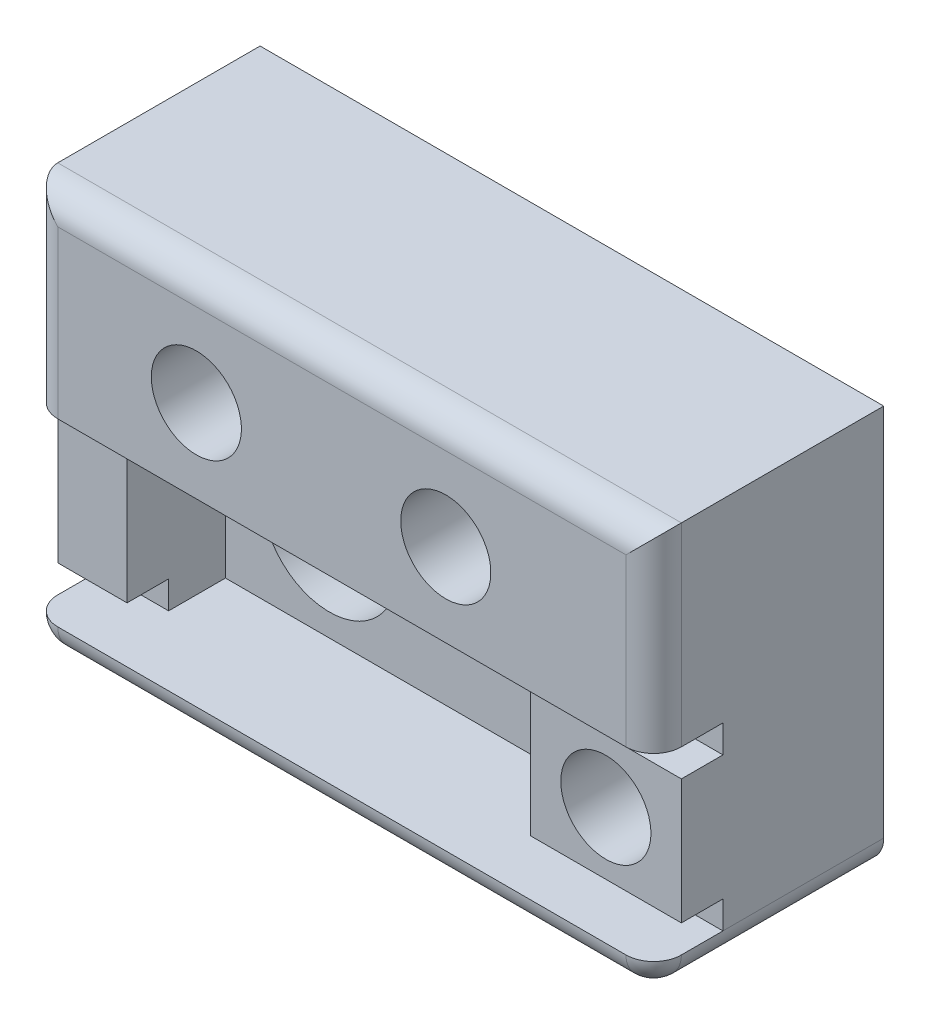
ISO-10303-21;
HEADER;
FILE_DESCRIPTION(('STEP AP214'),'2;1');
FILE_NAME('part.step','',(''),(''),'','','');
FILE_SCHEMA(('AUTOMOTIVE_DESIGN { 1 0 10303 214 1 1 1 1 }'));
ENDSEC;
DATA;
#1=APPLICATION_CONTEXT('core data for automotive mechanical design processes');
#2=APPLICATION_PROTOCOL_DEFINITION('international standard','automotive_design',2000,#1);
#3=PRODUCT_CONTEXT('',#1,'mechanical');
#4=PRODUCT('Part','Part','',(#3));
#5=PRODUCT_RELATED_PRODUCT_CATEGORY('part','',(#4));
#6=PRODUCT_DEFINITION_FORMATION('','',#4);
#7=PRODUCT_DEFINITION_CONTEXT('part definition',#1,'design');
#8=PRODUCT_DEFINITION('design','',#6,#7);
#9=PRODUCT_DEFINITION_SHAPE('','',#8);
#10=(LENGTH_UNIT() NAMED_UNIT(*) SI_UNIT(.MILLI.,.METRE.));
#11=(NAMED_UNIT(*) PLANE_ANGLE_UNIT() SI_UNIT($,.RADIAN.));
#12=(NAMED_UNIT(*) SI_UNIT($,.STERADIAN.) SOLID_ANGLE_UNIT());
#13=UNCERTAINTY_MEASURE_WITH_UNIT(LENGTH_MEASURE(1.E-05),#10,'distance_accuracy_value','');
#14=(GEOMETRIC_REPRESENTATION_CONTEXT(3) GLOBAL_UNCERTAINTY_ASSIGNED_CONTEXT((#13)) GLOBAL_UNIT_ASSIGNED_CONTEXT((#10,
#11,#12)) REPRESENTATION_CONTEXT('',''));
#15=CARTESIAN_POINT('',(0.,0.,0.));
#16=DIRECTION('',(0.,0.,1.));
#17=DIRECTION('',(1.,0.,0.));
#18=AXIS2_PLACEMENT_3D('',#15,#16,#17);
#19=CARTESIAN_POINT('',(30.,24.5,7.5));
#20=DIRECTION('',(0.,0.,-1.));
#21=DIRECTION('',(-1.,0.,0.));
#22=AXIS2_PLACEMENT_3D('',#19,#20,#21);
#23=CYLINDRICAL_SURFACE('',#22,1.65);
#24=CARTESIAN_POINT('',(30.,24.5,7.5));
#25=DIRECTION('',(0.,0.,1.));
#26=DIRECTION('',(1.,0.,0.));
#27=AXIS2_PLACEMENT_3D('',#24,#25,#26);
#28=CIRCLE('',#27,1.65);
#29=CARTESIAN_POINT('',(28.35,24.5,7.5));
#30=VERTEX_POINT('',#29);
#31=EDGE_CURVE('E380',#30,#30,#28,.F.);
#32=CARTESIAN_POINT('',(30.,24.5,9.5));
#33=DIRECTION('',(0.,0.,-1.));
#34=DIRECTION('',(-1.,0.,0.));
#35=AXIS2_PLACEMENT_3D('',#32,#33,#34);
#36=CIRCLE('',#35,1.65);
#37=CARTESIAN_POINT('',(28.35,24.5,9.5));
#38=VERTEX_POINT('',#37);
#39=EDGE_CURVE('E227',#38,#38,#36,.F.);
#40=CARTESIAN_POINT('',(28.35,24.5,7.5));
#41=CARTESIAN_POINT('',(28.35,24.5,7.52083333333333));
#42=CARTESIAN_POINT('',(28.35,24.5,7.54166666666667));
#43=CARTESIAN_POINT('',(28.35,24.5,7.58333333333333));
#44=CARTESIAN_POINT('',(28.35,24.5,7.60416666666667));
#45=CARTESIAN_POINT('',(28.35,24.5,7.64583333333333));
#46=CARTESIAN_POINT('',(28.35,24.5,7.66666666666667));
#47=CARTESIAN_POINT('',(28.35,24.5,7.70833333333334));
#48=CARTESIAN_POINT('',(28.35,24.5,7.72916666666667));
#49=CARTESIAN_POINT('',(28.35,24.5,7.77083333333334));
#50=CARTESIAN_POINT('',(28.35,24.5,7.79166666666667));
#51=CARTESIAN_POINT('',(28.35,24.5,7.83333333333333));
#52=CARTESIAN_POINT('',(28.35,24.5,7.85416666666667));
#53=CARTESIAN_POINT('',(28.35,24.5,7.89583333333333));
#54=CARTESIAN_POINT('',(28.35,24.5,7.91666666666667));
#55=CARTESIAN_POINT('',(28.35,24.5,7.95833333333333));
#56=CARTESIAN_POINT('',(28.35,24.5,7.97916666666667));
#57=CARTESIAN_POINT('',(28.35,24.5,8.02083333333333));
#58=CARTESIAN_POINT('',(28.35,24.5,8.04166666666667));
#59=CARTESIAN_POINT('',(28.35,24.5,8.08333333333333));
#60=CARTESIAN_POINT('',(28.35,24.5,8.10416666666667));
#61=CARTESIAN_POINT('',(28.35,24.5,8.14583333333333));
#62=CARTESIAN_POINT('',(28.35,24.5,8.16666666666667));
#63=CARTESIAN_POINT('',(28.35,24.5,8.20833333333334));
#64=CARTESIAN_POINT('',(28.35,24.5,8.22916666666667));
#65=CARTESIAN_POINT('',(28.35,24.5,8.27083333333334));
#66=CARTESIAN_POINT('',(28.35,24.5,8.29166666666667));
#67=CARTESIAN_POINT('',(28.35,24.5,8.33333333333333));
#68=CARTESIAN_POINT('',(28.35,24.5,8.35416666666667));
#69=CARTESIAN_POINT('',(28.35,24.5,8.39583333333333));
#70=CARTESIAN_POINT('',(28.35,24.5,8.41666666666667));
#71=CARTESIAN_POINT('',(28.35,24.5,8.45833333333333));
#72=CARTESIAN_POINT('',(28.35,24.5,8.47916666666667));
#73=CARTESIAN_POINT('',(28.35,24.5,8.52083333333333));
#74=CARTESIAN_POINT('',(28.35,24.5,8.54166666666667));
#75=CARTESIAN_POINT('',(28.35,24.5,8.58333333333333));
#76=CARTESIAN_POINT('',(28.35,24.5,8.60416666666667));
#77=CARTESIAN_POINT('',(28.35,24.5,8.64583333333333));
#78=CARTESIAN_POINT('',(28.35,24.5,8.66666666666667));
#79=CARTESIAN_POINT('',(28.35,24.5,8.70833333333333));
#80=CARTESIAN_POINT('',(28.35,24.5,8.72916666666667));
#81=CARTESIAN_POINT('',(28.35,24.5,8.77083333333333));
#82=CARTESIAN_POINT('',(28.35,24.5,8.79166666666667));
#83=CARTESIAN_POINT('',(28.35,24.5,8.83333333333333));
#84=CARTESIAN_POINT('',(28.35,24.5,8.85416666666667));
#85=CARTESIAN_POINT('',(28.35,24.5,8.89583333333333));
#86=CARTESIAN_POINT('',(28.35,24.5,8.91666666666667));
#87=CARTESIAN_POINT('',(28.35,24.5,8.95833333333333));
#88=CARTESIAN_POINT('',(28.35,24.5,8.97916666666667));
#89=CARTESIAN_POINT('',(28.35,24.5,9.02083333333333));
#90=CARTESIAN_POINT('',(28.35,24.5,9.04166666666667));
#91=CARTESIAN_POINT('',(28.35,24.5,9.08333333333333));
#92=CARTESIAN_POINT('',(28.35,24.5,9.10416666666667));
#93=CARTESIAN_POINT('',(28.35,24.5,9.14583333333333));
#94=CARTESIAN_POINT('',(28.35,24.5,9.16666666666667));
#95=CARTESIAN_POINT('',(28.35,24.5,9.20833333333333));
#96=CARTESIAN_POINT('',(28.35,24.5,9.22916666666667));
#97=CARTESIAN_POINT('',(28.35,24.5,9.27083333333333));
#98=CARTESIAN_POINT('',(28.35,24.5,9.29166666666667));
#99=CARTESIAN_POINT('',(28.35,24.5,9.33333333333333));
#100=CARTESIAN_POINT('',(28.35,24.5,9.35416666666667));
#101=CARTESIAN_POINT('',(28.35,24.5,9.39583333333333));
#102=CARTESIAN_POINT('',(28.35,24.5,9.41666666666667));
#103=CARTESIAN_POINT('',(28.35,24.5,9.45833333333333));
#104=CARTESIAN_POINT('',(28.35,24.5,9.47916666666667));
#105=CARTESIAN_POINT('',(28.35,24.5,9.5));
#106=B_SPLINE_CURVE_WITH_KNOTS('',3,(#40,#41,#42,#43,#44,#45,#46,#47,#48,#49,#50,#51,#52,#53,
#54,#55,#56,#57,#58,#59,#60,#61,#62,#63,#64,#65,#66,#67,#68,#69,#70,#71,#72,#73,#74,#75,#76,#77,
#78,#79,#80,#81,#82,#83,#84,#85,#86,#87,#88,#89,#90,#91,#92,#93,#94,#95,#96,#97,#98,#99,#100,
#101,#102,#103,#104,#105),.UNSPECIFIED.,.F.,.F.,(4,2,2,2,2,2,2,2,2,2,2,2,2,2,2,2,2,2,2,2,2,2,2,
2,2,2,2,2,2,2,2,2,4),(0.,0.0625000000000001,0.125,0.1875,0.25,0.3125,0.375,0.4375,0.5,0.5625,
0.625000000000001,0.687500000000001,0.750000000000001,0.812499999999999,0.874999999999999,
0.937499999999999,0.999999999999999,1.0625,1.125,1.1875,1.25,1.3125,1.375,1.4375,1.5,1.5625,
1.625,1.6875,1.75,1.8125,1.875,1.9375,2.),.UNSPECIFIED.);
#107=EDGE_CURVE('BSEAM35',#30,#38,#106,.T.);
#108=ORIENTED_EDGE('',*,*,#31,.T.);
#109=ORIENTED_EDGE('',*,*,#39,.T.);
#110=ORIENTED_EDGE('',*,*,#107,.T.);
#111=ORIENTED_EDGE('',*,*,#107,.F.);
#112=EDGE_LOOP('',(#108,#110,#109,#111));
#113=FACE_BOUND('',#112,.T.);
#114=ADVANCED_FACE('F35',(#113),#23,.F.);
#115=CARTESIAN_POINT('',(12.,24.5,7.5));
#116=DIRECTION('',(0.,0.,-1.));
#117=DIRECTION('',(-1.,0.,0.));
#118=AXIS2_PLACEMENT_3D('',#115,#116,#117);
#119=CYLINDRICAL_SURFACE('',#118,1.65);
#120=CARTESIAN_POINT('',(12.,24.5,7.5));
#121=DIRECTION('',(0.,0.,1.));
#122=DIRECTION('',(1.,0.,0.));
#123=AXIS2_PLACEMENT_3D('',#120,#121,#122);
#124=CIRCLE('',#123,1.65);
#125=CARTESIAN_POINT('',(10.35,24.5,7.5));
#126=VERTEX_POINT('',#125);
#127=EDGE_CURVE('E525',#126,#126,#124,.F.);
#128=CARTESIAN_POINT('',(12.,24.5,9.5));
#129=DIRECTION('',(0.,0.,-1.));
#130=DIRECTION('',(-1.,0.,0.));
#131=AXIS2_PLACEMENT_3D('',#128,#129,#130);
#132=CIRCLE('',#131,1.65);
#133=CARTESIAN_POINT('',(10.35,24.5,9.5));
#134=VERTEX_POINT('',#133);
#135=EDGE_CURVE('E364',#134,#134,#132,.F.);
#136=CARTESIAN_POINT('',(10.35,24.5,7.5));
#137=CARTESIAN_POINT('',(10.35,24.5,7.52083333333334));
#138=CARTESIAN_POINT('',(10.35,24.5,7.54166666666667));
#139=CARTESIAN_POINT('',(10.35,24.5,7.58333333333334));
#140=CARTESIAN_POINT('',(10.35,24.5,7.60416666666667));
#141=CARTESIAN_POINT('',(10.35,24.5,7.64583333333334));
#142=CARTESIAN_POINT('',(10.35,24.5,7.66666666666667));
#143=CARTESIAN_POINT('',(10.35,24.5,7.70833333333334));
#144=CARTESIAN_POINT('',(10.35,24.5,7.72916666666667));
#145=CARTESIAN_POINT('',(10.35,24.5,7.77083333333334));
#146=CARTESIAN_POINT('',(10.35,24.5,7.79166666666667));
#147=CARTESIAN_POINT('',(10.35,24.5,7.83333333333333));
#148=CARTESIAN_POINT('',(10.35,24.5,7.85416666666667));
#149=CARTESIAN_POINT('',(10.35,24.5,7.89583333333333));
#150=CARTESIAN_POINT('',(10.35,24.5,7.91666666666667));
#151=CARTESIAN_POINT('',(10.35,24.5,7.95833333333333));
#152=CARTESIAN_POINT('',(10.35,24.5,7.97916666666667));
#153=CARTESIAN_POINT('',(10.35,24.5,8.02083333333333));
#154=CARTESIAN_POINT('',(10.35,24.5,8.04166666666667));
#155=CARTESIAN_POINT('',(10.35,24.5,8.08333333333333));
#156=CARTESIAN_POINT('',(10.35,24.5,8.10416666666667));
#157=CARTESIAN_POINT('',(10.35,24.5,8.14583333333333));
#158=CARTESIAN_POINT('',(10.35,24.5,8.16666666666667));
#159=CARTESIAN_POINT('',(10.35,24.5,8.20833333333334));
#160=CARTESIAN_POINT('',(10.35,24.5,8.22916666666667));
#161=CARTESIAN_POINT('',(10.35,24.5,8.27083333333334));
#162=CARTESIAN_POINT('',(10.35,24.5,8.29166666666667));
#163=CARTESIAN_POINT('',(10.35,24.5,8.33333333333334));
#164=CARTESIAN_POINT('',(10.35,24.5,8.35416666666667));
#165=CARTESIAN_POINT('',(10.35,24.5,8.39583333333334));
#166=CARTESIAN_POINT('',(10.35,24.5,8.41666666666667));
#167=CARTESIAN_POINT('',(10.35,24.5,8.45833333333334));
#168=CARTESIAN_POINT('',(10.35,24.5,8.47916666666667));
#169=CARTESIAN_POINT('',(10.35,24.5,8.52083333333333));
#170=CARTESIAN_POINT('',(10.35,24.5,8.54166666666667));
#171=CARTESIAN_POINT('',(10.35,24.5,8.58333333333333));
#172=CARTESIAN_POINT('',(10.35,24.5,8.60416666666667));
#173=CARTESIAN_POINT('',(10.35,24.5,8.64583333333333));
#174=CARTESIAN_POINT('',(10.35,24.5,8.66666666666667));
#175=CARTESIAN_POINT('',(10.35,24.5,8.70833333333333));
#176=CARTESIAN_POINT('',(10.35,24.5,8.72916666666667));
#177=CARTESIAN_POINT('',(10.35,24.5,8.77083333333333));
#178=CARTESIAN_POINT('',(10.35,24.5,8.79166666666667));
#179=CARTESIAN_POINT('',(10.35,24.5,8.83333333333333));
#180=CARTESIAN_POINT('',(10.35,24.5,8.85416666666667));
#181=CARTESIAN_POINT('',(10.35,24.5,8.89583333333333));
#182=CARTESIAN_POINT('',(10.35,24.5,8.91666666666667));
#183=CARTESIAN_POINT('',(10.35,24.5,8.95833333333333));
#184=CARTESIAN_POINT('',(10.35,24.5,8.97916666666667));
#185=CARTESIAN_POINT('',(10.35,24.5,9.02083333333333));
#186=CARTESIAN_POINT('',(10.35,24.5,9.04166666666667));
#187=CARTESIAN_POINT('',(10.35,24.5,9.08333333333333));
#188=CARTESIAN_POINT('',(10.35,24.5,9.10416666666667));
#189=CARTESIAN_POINT('',(10.35,24.5,9.14583333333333));
#190=CARTESIAN_POINT('',(10.35,24.5,9.16666666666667));
#191=CARTESIAN_POINT('',(10.35,24.5,9.20833333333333));
#192=CARTESIAN_POINT('',(10.35,24.5,9.22916666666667));
#193=CARTESIAN_POINT('',(10.35,24.5,9.27083333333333));
#194=CARTESIAN_POINT('',(10.35,24.5,9.29166666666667));
#195=CARTESIAN_POINT('',(10.35,24.5,9.33333333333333));
#196=CARTESIAN_POINT('',(10.35,24.5,9.35416666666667));
#197=CARTESIAN_POINT('',(10.35,24.5,9.39583333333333));
#198=CARTESIAN_POINT('',(10.35,24.5,9.41666666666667));
#199=CARTESIAN_POINT('',(10.35,24.5,9.45833333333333));
#200=CARTESIAN_POINT('',(10.35,24.5,9.47916666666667));
#201=CARTESIAN_POINT('',(10.35,24.5,9.5));
#202=B_SPLINE_CURVE_WITH_KNOTS('',3,(#136,#137,#138,#139,#140,#141,#142,#143,#144,#145,#146,
#147,#148,#149,#150,#151,#152,#153,#154,#155,#156,#157,#158,#159,#160,#161,#162,#163,#164,#165,
#166,#167,#168,#169,#170,#171,#172,#173,#174,#175,#176,#177,#178,#179,#180,#181,#182,#183,#184,
#185,#186,#187,#188,#189,#190,#191,#192,#193,#194,#195,#196,#197,#198,#199,#200,#201),
.UNSPECIFIED.,.F.,.F.,(4,2,2,2,2,2,2,2,2,2,2,2,2,2,2,2,2,2,2,2,2,2,2,2,2,2,2,2,2,2,2,2,4),(0.,
0.0625000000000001,0.125,0.1875,0.25,0.312499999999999,0.374999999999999,0.4375,0.5,0.5625,
0.625,0.6875,0.75,0.8125,0.875,0.9375,0.999999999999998,1.0625,1.125,1.1875,1.25,1.3125,1.375,
1.4375,1.5,1.5625,1.625,1.6875,1.75,1.8125,1.875,1.9375,2.),.UNSPECIFIED.);
#203=EDGE_CURVE('BSEAM480',#126,#134,#202,.T.);
#204=ORIENTED_EDGE('',*,*,#127,.T.);
#205=ORIENTED_EDGE('',*,*,#135,.T.);
#206=ORIENTED_EDGE('',*,*,#203,.T.);
#207=ORIENTED_EDGE('',*,*,#203,.F.);
#208=EDGE_LOOP('',(#204,#206,#205,#207));
#209=FACE_BOUND('',#208,.T.);
#210=ADVANCED_FACE('F480',(#209),#119,.F.);
#211=CARTESIAN_POINT('',(39.55,12.,7.5));
#212=DIRECTION('',(0.,0.,-1.));
#213=DIRECTION('',(-1.,0.,0.));
#214=AXIS2_PLACEMENT_3D('',#211,#212,#213);
#215=CYLINDRICAL_SURFACE('',#214,1.65);
#216=CARTESIAN_POINT('',(39.55,12.,7.5));
#217=DIRECTION('',(0.,0.,1.));
#218=DIRECTION('',(1.,0.,0.));
#219=AXIS2_PLACEMENT_3D('',#216,#217,#218);
#220=CIRCLE('',#219,1.65);
#221=CARTESIAN_POINT('',(41.2,12.,7.5));
#222=VERTEX_POINT('',#221);
#223=EDGE_CURVE('E523',#222,#222,#220,.F.);
#224=ORIENTED_EDGE('',*,*,#223,.T.);
#225=EDGE_LOOP('',(#224));
#226=FACE_BOUND('',#225,.T.);
#227=CARTESIAN_POINT('',(39.55,12.,9.5));
#228=DIRECTION('',(0.,0.,-1.));
#229=DIRECTION('',(-1.,0.,0.));
#230=AXIS2_PLACEMENT_3D('',#227,#228,#229);
#231=CIRCLE('',#230,1.65);
#232=CARTESIAN_POINT('',(37.9,12.,9.5));
#233=VERTEX_POINT('',#232);
#234=EDGE_CURVE('E274',#233,#233,#231,.F.);
#235=ORIENTED_EDGE('',*,*,#234,.T.);
#236=EDGE_LOOP('',(#235));
#237=FACE_BOUND('',#236,.T.);
#238=ADVANCED_FACE('F486',(#226,#237),#215,.F.);
#239=CARTESIAN_POINT('',(45.,32.5,7.5));
#240=DIRECTION('',(-1.,0.,0.));
#241=DIRECTION('',(0.,-1.,0.));
#242=AXIS2_PLACEMENT_3D('',#239,#240,#241);
#243=PLANE('',#242);
#244=DIRECTION('',(0.,0.,1.));
#245=VECTOR('',#244,1.);
#246=CARTESIAN_POINT('',(45.,5.50000000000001,7.5));
#247=LINE('',#246,#245);
#248=CARTESIAN_POINT('',(45.,5.50000000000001,19.1));
#249=VERTEX_POINT('',#248);
#250=CARTESIAN_POINT('',(45.,5.5,7.5));
#251=VERTEX_POINT('',#250);
#252=EDGE_CURVE('E43',#249,#251,#247,.F.);
#253=ORIENTED_EDGE('',*,*,#252,.T.);
#254=DIRECTION('',(0.,1.,0.));
#255=VECTOR('',#254,1.);
#256=CARTESIAN_POINT('',(45.,32.5,7.5));
#257=LINE('',#256,#255);
#258=CARTESIAN_POINT('',(45.,32.5,7.5));
#259=VERTEX_POINT('',#258);
#260=EDGE_CURVE('E238',#251,#259,#257,.T.);
#261=ORIENTED_EDGE('',*,*,#260,.T.);
#262=DIRECTION('',(0.,0.,-1.));
#263=VECTOR('',#262,1.);
#264=CARTESIAN_POINT('',(45.,32.5,7.5));
#265=LINE('',#264,#263);
#266=CARTESIAN_POINT('',(45.,32.5,22.1));
#267=VERTEX_POINT('',#266);
#268=EDGE_CURVE('E211',#267,#259,#265,.T.);
#269=ORIENTED_EDGE('',*,*,#268,.F.);
#270=DIRECTION('',(0.,-1.,0.));
#271=VECTOR('',#270,1.);
#272=CARTESIAN_POINT('',(45.,32.5,22.1));
#273=LINE('',#272,#271);
#274=CARTESIAN_POINT('',(45.,18.5,22.1));
#275=VERTEX_POINT('',#274);
#276=EDGE_CURVE('E338',#275,#267,#273,.F.);
#277=ORIENTED_EDGE('',*,*,#276,.F.);
#278=DIRECTION('',(0.,0.,1.));
#279=VECTOR('',#278,1.);
#280=CARTESIAN_POINT('',(45.,18.5,7.5));
#281=LINE('',#280,#279);
#282=CARTESIAN_POINT('',(45.,18.5,19.1));
#283=VERTEX_POINT('',#282);
#284=EDGE_CURVE('E404',#283,#275,#281,.T.);
#285=ORIENTED_EDGE('',*,*,#284,.F.);
#286=DIRECTION('',(0.,1.,0.));
#287=VECTOR('',#286,1.);
#288=CARTESIAN_POINT('',(45.,32.5,19.1));
#289=LINE('',#288,#287);
#290=CARTESIAN_POINT('',(45.,16.5,19.1));
#291=VERTEX_POINT('',#290);
#292=EDGE_CURVE('E258',#291,#283,#289,.T.);
#293=ORIENTED_EDGE('',*,*,#292,.F.);
#294=DIRECTION('',(0.,0.,-1.));
#295=VECTOR('',#294,1.);
#296=CARTESIAN_POINT('',(45.,16.5,7.5));
#297=LINE('',#296,#295);
#298=CARTESIAN_POINT('',(45.,16.5,22.1));
#299=VERTEX_POINT('',#298);
#300=EDGE_CURVE('E264',#299,#291,#297,.T.);
#301=ORIENTED_EDGE('',*,*,#300,.F.);
#302=DIRECTION('',(0.,-1.,0.));
#303=VECTOR('',#302,1.);
#304=CARTESIAN_POINT('',(45.,32.5,22.1));
#305=LINE('',#304,#303);
#306=CARTESIAN_POINT('',(45.,7.49999999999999,22.1));
#307=VERTEX_POINT('',#306);
#308=EDGE_CURVE('E311',#299,#307,#305,.T.);
#309=ORIENTED_EDGE('',*,*,#308,.T.);
#310=DIRECTION('',(0.,0.,1.));
#311=VECTOR('',#310,1.);
#312=CARTESIAN_POINT('',(45.,7.5,7.5));
#313=LINE('',#312,#311);
#314=CARTESIAN_POINT('',(45.,7.49999999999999,19.1));
#315=VERTEX_POINT('',#314);
#316=EDGE_CURVE('E243',#315,#307,#313,.T.);
#317=ORIENTED_EDGE('',*,*,#316,.F.);
#318=DIRECTION('',(0.,-1.,0.));
#319=VECTOR('',#318,1.);
#320=CARTESIAN_POINT('',(45.,32.5,19.1));
#321=LINE('',#320,#319);
#322=EDGE_CURVE('E241',#315,#249,#321,.T.);
#323=ORIENTED_EDGE('',*,*,#322,.T.);
#324=EDGE_LOOP('',(#253,#261,#269,#277,#285,#293,#301,#309,#317,#323));
#325=FACE_BOUND('',#324,.T.);
#326=ADVANCED_FACE('F237',(#325),#243,.F.);
#327=CARTESIAN_POINT('',(0.,32.5,7.5));
#328=DIRECTION('',(0.,-1.,0.));
#329=DIRECTION('',(0.,0.,-1.));
#330=AXIS2_PLACEMENT_3D('',#327,#328,#329);
#331=PLANE('',#330);
#332=ORIENTED_EDGE('',*,*,#268,.T.);
#333=DIRECTION('',(-1.,0.,0.));
#334=VECTOR('',#333,1.);
#335=CARTESIAN_POINT('',(0.,32.5,7.5));
#336=LINE('',#335,#334);
#337=CARTESIAN_POINT('',(0.,32.5,7.5));
#338=VERTEX_POINT('',#337);
#339=EDGE_CURVE('E198',#259,#338,#336,.T.);
#340=ORIENTED_EDGE('',*,*,#339,.T.);
#341=DIRECTION('',(0.,0.,-1.));
#342=VECTOR('',#341,1.);
#343=CARTESIAN_POINT('',(0.,32.5,7.5));
#344=LINE('',#343,#342);
#345=CARTESIAN_POINT('',(0.,32.5,22.1));
#346=VERTEX_POINT('',#345);
#347=EDGE_CURVE('E209',#346,#338,#344,.T.);
#348=ORIENTED_EDGE('',*,*,#347,.F.);
#349=DIRECTION('',(1.,0.,0.));
#350=VECTOR('',#349,1.);
#351=CARTESIAN_POINT('',(0.,32.5,22.1));
#352=LINE('',#351,#350);
#353=EDGE_CURVE('E332',#267,#346,#352,.F.);
#354=ORIENTED_EDGE('',*,*,#353,.F.);
#355=EDGE_LOOP('',(#332,#340,#348,#354));
#356=FACE_BOUND('',#355,.T.);
#357=ADVANCED_FACE('F207',(#356),#331,.F.);
#358=CARTESIAN_POINT('',(0.,32.5,7.5));
#359=DIRECTION('',(1.,0.,0.));
#360=DIRECTION('',(0.,1.,0.));
#361=AXIS2_PLACEMENT_3D('',#358,#359,#360);
#362=PLANE('',#361);
#363=ORIENTED_EDGE('',*,*,#347,.T.);
#364=DIRECTION('',(0.,-1.,0.));
#365=VECTOR('',#364,1.);
#366=CARTESIAN_POINT('',(0.,32.5,7.5));
#367=LINE('',#366,#365);
#368=CARTESIAN_POINT('',(0.,5.50000000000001,7.5));
#369=VERTEX_POINT('',#368);
#370=EDGE_CURVE('E194',#338,#369,#367,.T.);
#371=ORIENTED_EDGE('',*,*,#370,.T.);
#372=DIRECTION('',(0.,0.,1.));
#373=VECTOR('',#372,1.);
#374=CARTESIAN_POINT('',(0.,5.50000000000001,7.5));
#375=LINE('',#374,#373);
#376=CARTESIAN_POINT('',(0.,5.5,19.1));
#377=VERTEX_POINT('',#376);
#378=EDGE_CURVE('E234',#369,#377,#375,.T.);
#379=ORIENTED_EDGE('',*,*,#378,.T.);
#380=DIRECTION('',(0.,1.,0.));
#381=VECTOR('',#380,1.);
#382=CARTESIAN_POINT('',(0.,5.5,19.1));
#383=LINE('',#382,#381);
#384=CARTESIAN_POINT('',(0.,7.5,19.1));
#385=VERTEX_POINT('',#384);
#386=EDGE_CURVE('E388',#377,#385,#383,.T.);
#387=ORIENTED_EDGE('',*,*,#386,.T.);
#388=DIRECTION('',(0.,0.,1.));
#389=VECTOR('',#388,1.);
#390=CARTESIAN_POINT('',(0.,7.5,19.1));
#391=LINE('',#390,#389);
#392=CARTESIAN_POINT('',(0.,7.5,22.1));
#393=VERTEX_POINT('',#392);
#394=EDGE_CURVE('E402',#385,#393,#391,.T.);
#395=ORIENTED_EDGE('',*,*,#394,.T.);
#396=DIRECTION('',(0.,1.,0.));
#397=VECTOR('',#396,1.);
#398=CARTESIAN_POINT('',(0.,3.5,22.1));
#399=LINE('',#398,#397);
#400=CARTESIAN_POINT('',(0.,16.5,22.1));
#401=VERTEX_POINT('',#400);
#402=EDGE_CURVE('E313',#393,#401,#399,.T.);
#403=ORIENTED_EDGE('',*,*,#402,.T.);
#404=DIRECTION('',(0.,0.,1.));
#405=VECTOR('',#404,1.);
#406=CARTESIAN_POINT('',(0.,16.5,19.1));
#407=LINE('',#406,#405);
#408=CARTESIAN_POINT('',(0.,16.5,19.1));
#409=VERTEX_POINT('',#408);
#410=EDGE_CURVE('E417',#409,#401,#407,.T.);
#411=ORIENTED_EDGE('',*,*,#410,.F.);
#412=DIRECTION('',(0.,1.,0.));
#413=VECTOR('',#412,1.);
#414=CARTESIAN_POINT('',(0.,18.5,19.1));
#415=LINE('',#414,#413);
#416=CARTESIAN_POINT('',(0.,18.5,19.1));
#417=VERTEX_POINT('',#416);
#418=EDGE_CURVE('E405',#409,#417,#415,.T.);
#419=ORIENTED_EDGE('',*,*,#418,.T.);
#420=DIRECTION('',(0.,0.,1.));
#421=VECTOR('',#420,1.);
#422=CARTESIAN_POINT('',(0.,18.5,19.1));
#423=LINE('',#422,#421);
#424=CARTESIAN_POINT('',(0.,18.5,22.1));
#425=VERTEX_POINT('',#424);
#426=EDGE_CURVE('E419',#417,#425,#423,.T.);
#427=ORIENTED_EDGE('',*,*,#426,.T.);
#428=DIRECTION('',(0.,1.,0.));
#429=VECTOR('',#428,1.);
#430=CARTESIAN_POINT('',(0.,18.5,22.1));
#431=LINE('',#430,#429);
#432=EDGE_CURVE('E217',#346,#425,#431,.F.);
#433=ORIENTED_EDGE('',*,*,#432,.F.);
#434=EDGE_LOOP('',(#363,#371,#379,#387,#395,#403,#411,#419,#427,#433));
#435=FACE_BOUND('',#434,.T.);
#436=ADVANCED_FACE('F214',(#435),#362,.F.);
#437=CARTESIAN_POINT('',(12.5,12.,7.5));
#438=DIRECTION('',(0.,0.,-1.));
#439=DIRECTION('',(-1.,0.,0.));
#440=AXIS2_PLACEMENT_3D('',#437,#438,#439);
#441=CYLINDRICAL_SURFACE('',#440,4.875);
#442=CARTESIAN_POINT('',(12.5,12.,7.5));
#443=DIRECTION('',(0.,0.,1.));
#444=DIRECTION('',(1.,0.,0.));
#445=AXIS2_PLACEMENT_3D('',#442,#443,#444);
#446=CIRCLE('',#445,4.875);
#447=CARTESIAN_POINT('',(17.375,12.,7.5));
#448=VERTEX_POINT('',#447);
#449=EDGE_CURVE('E517',#448,#448,#446,.T.);
#450=ORIENTED_EDGE('',*,*,#449,.F.);
#451=EDGE_LOOP('',(#450));
#452=FACE_BOUND('',#451,.T.);
#453=CARTESIAN_POINT('',(12.5,12.,15.));
#454=DIRECTION('',(0.,0.,1.));
#455=DIRECTION('',(1.,0.,0.));
#456=AXIS2_PLACEMENT_3D('',#453,#454,#455);
#457=CIRCLE('',#456,4.875);
#458=CARTESIAN_POINT('',(17.375,12.,15.));
#459=VERTEX_POINT('',#458);
#460=EDGE_CURVE('E316',#459,#459,#457,.T.);
#461=ORIENTED_EDGE('',*,*,#460,.T.);
#462=EDGE_LOOP('',(#461));
#463=FACE_BOUND('',#462,.T.);
#464=ADVANCED_FACE('F499',(#452,#463),#441,.F.);
#465=CARTESIAN_POINT('',(45.,3.5,-7.1));
#466=DIRECTION('',(0.,1.,0.));
#467=DIRECTION('',(0.,0.,1.));
#468=AXIS2_PLACEMENT_3D('',#465,#466,#467);
#469=PLANE('',#468);
#470=DIRECTION('',(0.,0.,1.));
#471=VECTOR('',#470,1.);
#472=CARTESIAN_POINT('',(2.00000000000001,3.5,-7.1));
#473=LINE('',#472,#471);
#474=CARTESIAN_POINT('',(2.00000000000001,3.5,22.1));
#475=VERTEX_POINT('',#474);
#476=CARTESIAN_POINT('',(2.00000000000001,3.5,7.5));
#477=VERTEX_POINT('',#476);
#478=EDGE_CURVE('E231',#475,#477,#473,.F.);
#479=ORIENTED_EDGE('',*,*,#478,.T.);
#480=DIRECTION('',(-1.,0.,0.));
#481=VECTOR('',#480,1.);
#482=CARTESIAN_POINT('',(0.,3.5,7.5));
#483=LINE('',#482,#481);
#484=CARTESIAN_POINT('',(43.,3.5,7.5));
#485=VERTEX_POINT('',#484);
#486=EDGE_CURVE('E49',#485,#477,#483,.T.);
#487=ORIENTED_EDGE('',*,*,#486,.F.);
#488=DIRECTION('',(0.,0.,1.));
#489=VECTOR('',#488,1.);
#490=CARTESIAN_POINT('',(43.,3.5,-7.1));
#491=LINE('',#490,#489);
#492=CARTESIAN_POINT('',(43.,3.5,22.1));
#493=VERTEX_POINT('',#492);
#494=EDGE_CURVE('E221',#485,#493,#491,.T.);
#495=ORIENTED_EDGE('',*,*,#494,.T.);
#496=DIRECTION('',(-1.,0.,0.));
#497=VECTOR('',#496,1.);
#498=CARTESIAN_POINT('',(45.,3.5,22.1));
#499=LINE('',#498,#497);
#500=EDGE_CURVE('E319',#475,#493,#499,.F.);
#501=ORIENTED_EDGE('',*,*,#500,.F.);
#502=EDGE_LOOP('',(#479,#487,#495,#501));
#503=FACE_BOUND('',#502,.T.);
#504=ADVANCED_FACE('F496',(#503),#469,.F.);
#505=CARTESIAN_POINT('',(43.,5.5,-7.1));
#506=DIRECTION('',(0.,0.,1.));
#507=DIRECTION('',(1.,0.,0.));
#508=AXIS2_PLACEMENT_3D('',#505,#506,#507);
#509=CYLINDRICAL_SURFACE('',#508,2.);
#510=CARTESIAN_POINT('',(43.,5.5,7.5));
#511=DIRECTION('',(0.,0.,1.));
#512=DIRECTION('',(1.,0.,0.));
#513=AXIS2_PLACEMENT_3D('',#510,#511,#512);
#514=CIRCLE('',#513,2.);
#515=EDGE_CURVE('E203',#251,#485,#514,.F.);
#516=ORIENTED_EDGE('',*,*,#515,.F.);
#517=ORIENTED_EDGE('',*,*,#252,.F.);
#518=DIRECTION('',(0.,0.,-1.));
#519=VECTOR('',#518,1.);
#520=CARTESIAN_POINT('',(45.,5.49999999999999,22.1));
#521=LINE('',#520,#519);
#522=CARTESIAN_POINT('',(45.,5.49999999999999,22.1));
#523=VERTEX_POINT('',#522);
#524=EDGE_CURVE('E423',#249,#523,#521,.F.);
#525=ORIENTED_EDGE('',*,*,#524,.T.);
#526=CARTESIAN_POINT('',(43.,5.5,22.1));
#527=DIRECTION('',(0.,0.,-1.));
#528=DIRECTION('',(-1.,0.,0.));
#529=AXIS2_PLACEMENT_3D('',#526,#527,#528);
#530=CIRCLE('',#529,2.);
#531=EDGE_CURVE('E278',#523,#493,#530,.T.);
#532=ORIENTED_EDGE('',*,*,#531,.T.);
#533=ORIENTED_EDGE('',*,*,#494,.F.);
#534=EDGE_LOOP('',(#516,#517,#525,#532,#533));
#535=FACE_BOUND('',#534,.T.);
#536=ADVANCED_FACE('F37',(#535),#509,.T.);
#537=CARTESIAN_POINT('',(2.00000000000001,5.50000000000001,7.5));
#538=DIRECTION('',(0.,0.,1.));
#539=DIRECTION('',(1.,0.,0.));
#540=AXIS2_PLACEMENT_3D('',#537,#538,#539);
#541=CYLINDRICAL_SURFACE('',#540,2.);
#542=CARTESIAN_POINT('',(2.00000000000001,5.50000000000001,7.5));
#543=DIRECTION('',(0.,0.,1.));
#544=DIRECTION('',(1.,0.,0.));
#545=AXIS2_PLACEMENT_3D('',#542,#543,#544);
#546=CIRCLE('',#545,2.);
#547=EDGE_CURVE('E11',#477,#369,#546,.F.);
#548=ORIENTED_EDGE('',*,*,#547,.F.);
#549=ORIENTED_EDGE('',*,*,#478,.F.);
#550=CARTESIAN_POINT('',(2.00000000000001,5.5,22.1));
#551=DIRECTION('',(0.,0.,-1.));
#552=DIRECTION('',(-1.,0.,0.));
#553=AXIS2_PLACEMENT_3D('',#550,#551,#552);
#554=CIRCLE('',#553,2.);
#555=CARTESIAN_POINT('',(0.,5.5,22.1));
#556=VERTEX_POINT('',#555);
#557=EDGE_CURVE('E358',#475,#556,#554,.T.);
#558=ORIENTED_EDGE('',*,*,#557,.T.);
#559=DIRECTION('',(0.,0.,-1.));
#560=VECTOR('',#559,1.);
#561=CARTESIAN_POINT('',(0.,5.50000000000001,7.5));
#562=LINE('',#561,#560);
#563=EDGE_CURVE('E335',#556,#377,#562,.T.);
#564=ORIENTED_EDGE('',*,*,#563,.T.);
#565=ORIENTED_EDGE('',*,*,#378,.F.);
#566=EDGE_LOOP('',(#548,#549,#558,#564,#565));
#567=FACE_BOUND('',#566,.T.);
#568=ADVANCED_FACE('F440',(#567),#541,.T.);
#569=CARTESIAN_POINT('',(0.,0.,22.1));
#570=DIRECTION('',(0.,0.,1.));
#571=DIRECTION('',(-1.,0.,0.));
#572=AXIS2_PLACEMENT_3D('',#569,#570,#571);
#573=PLANE('',#572);
#574=DIRECTION('',(1.,0.,0.));
#575=VECTOR('',#574,1.);
#576=CARTESIAN_POINT('',(0.,7.5,22.1));
#577=LINE('',#576,#575);
#578=CARTESIAN_POINT('',(34.1,7.49999999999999,22.1));
#579=VERTEX_POINT('',#578);
#580=EDGE_CURVE('E401',#579,#307,#577,.T.);
#581=ORIENTED_EDGE('',*,*,#580,.T.);
#582=ORIENTED_EDGE('',*,*,#308,.F.);
#583=DIRECTION('',(-1.,0.,0.));
#584=VECTOR('',#583,1.);
#585=CARTESIAN_POINT('',(0.,16.5,22.1));
#586=LINE('',#585,#584);
#587=CARTESIAN_POINT('',(34.1,16.5,22.1));
#588=VERTEX_POINT('',#587);
#589=EDGE_CURVE('E409',#299,#588,#586,.T.);
#590=ORIENTED_EDGE('',*,*,#589,.T.);
#591=DIRECTION('',(0.,-1.,0.));
#592=VECTOR('',#591,1.);
#593=CARTESIAN_POINT('',(34.1,5.5,22.1));
#594=LINE('',#593,#592);
#595=EDGE_CURVE('E286',#588,#579,#594,.T.);
#596=ORIENTED_EDGE('',*,*,#595,.T.);
#597=EDGE_LOOP('',(#581,#582,#590,#596));
#598=FACE_BOUND('',#597,.T.);
#599=CARTESIAN_POINT('',(39.55,12.,22.1));
#600=DIRECTION('',(0.,0.,-1.));
#601=DIRECTION('',(-1.,0.,0.));
#602=AXIS2_PLACEMENT_3D('',#599,#600,#601);
#603=CIRCLE('',#602,3.25);
#604=CARTESIAN_POINT('',(36.3,12.,22.1));
#605=VERTEX_POINT('',#604);
#606=EDGE_CURVE('E275',#605,#605,#603,.T.);
#607=ORIENTED_EDGE('',*,*,#606,.T.);
#608=EDGE_LOOP('',(#607));
#609=FACE_BOUND('',#608,.T.);
#610=ADVANCED_FACE('F468',(#598,#609),#573,.T.);
#611=CARTESIAN_POINT('',(5.00000000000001,7.5,22.1));
#612=VERTEX_POINT('',#611);
#613=EDGE_CURVE('E392',#393,#612,#577,.T.);
#614=ORIENTED_EDGE('',*,*,#613,.T.);
#615=DIRECTION('',(0.,1.,0.));
#616=VECTOR('',#615,1.);
#617=CARTESIAN_POINT('',(5.00000000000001,18.5,22.1));
#618=LINE('',#617,#616);
#619=CARTESIAN_POINT('',(5.00000000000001,16.5,22.1));
#620=VERTEX_POINT('',#619);
#621=EDGE_CURVE('E289',#612,#620,#618,.T.);
#622=ORIENTED_EDGE('',*,*,#621,.T.);
#623=EDGE_CURVE('E370',#620,#401,#586,.T.);
#624=ORIENTED_EDGE('',*,*,#623,.T.);
#625=ORIENTED_EDGE('',*,*,#402,.F.);
#626=EDGE_LOOP('',(#614,#622,#624,#625));
#627=FACE_BOUND('',#626,.T.);
#628=ADVANCED_FACE('F466',(#627),#573,.T.);
#629=CARTESIAN_POINT('',(0.,0.,15.));
#630=DIRECTION('',(0.,0.,1.));
#631=DIRECTION('',(-1.,0.,0.));
#632=AXIS2_PLACEMENT_3D('',#629,#630,#631);
#633=PLANE('',#632);
#634=ORIENTED_EDGE('',*,*,#460,.F.);
#635=EDGE_LOOP('',(#634));
#636=FACE_BOUND('',#635,.T.);
#637=DIRECTION('',(1.,0.,0.));
#638=VECTOR('',#637,1.);
#639=CARTESIAN_POINT('',(34.1,18.5,15.));
#640=LINE('',#639,#638);
#641=CARTESIAN_POINT('',(5.00000000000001,18.5,15.));
#642=VERTEX_POINT('',#641);
#643=CARTESIAN_POINT('',(34.1,18.5,15.));
#644=VERTEX_POINT('',#643);
#645=EDGE_CURVE('E290',#642,#644,#640,.T.);
#646=ORIENTED_EDGE('',*,*,#645,.F.);
#647=DIRECTION('',(0.,1.,0.));
#648=VECTOR('',#647,1.);
#649=CARTESIAN_POINT('',(5.00000000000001,18.5,15.));
#650=LINE('',#649,#648);
#651=CARTESIAN_POINT('',(5.00000000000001,5.50000000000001,15.));
#652=VERTEX_POINT('',#651);
#653=EDGE_CURVE('E299',#652,#642,#650,.T.);
#654=ORIENTED_EDGE('',*,*,#653,.F.);
#655=DIRECTION('',(-1.,0.,0.));
#656=VECTOR('',#655,1.);
#657=CARTESIAN_POINT('',(5.00000000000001,5.50000000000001,15.));
#658=LINE('',#657,#656);
#659=CARTESIAN_POINT('',(34.1,5.5,15.));
#660=VERTEX_POINT('',#659);
#661=EDGE_CURVE('E296',#660,#652,#658,.T.);
#662=ORIENTED_EDGE('',*,*,#661,.F.);
#663=DIRECTION('',(0.,-1.,0.));
#664=VECTOR('',#663,1.);
#665=CARTESIAN_POINT('',(34.1,5.5,15.));
#666=LINE('',#665,#664);
#667=EDGE_CURVE('E285',#644,#660,#666,.T.);
#668=ORIENTED_EDGE('',*,*,#667,.F.);
#669=EDGE_LOOP('',(#646,#654,#662,#668));
#670=FACE_BOUND('',#669,.T.);
#671=ADVANCED_FACE('F451',(#636,#670),#633,.T.);
#672=CARTESIAN_POINT('',(34.1,5.5,22.1));
#673=DIRECTION('',(-1.,0.,0.));
#674=DIRECTION('',(0.,0.,-1.));
#675=AXIS2_PLACEMENT_3D('',#672,#673,#674);
#676=PLANE('',#675);
#677=DIRECTION('',(0.,0.,1.));
#678=VECTOR('',#677,1.);
#679=CARTESIAN_POINT('',(34.1,7.49999999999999,22.1));
#680=LINE('',#679,#678);
#681=CARTESIAN_POINT('',(34.1,7.49999999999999,19.1));
#682=VERTEX_POINT('',#681);
#683=EDGE_CURVE('E267',#682,#579,#680,.T.);
#684=ORIENTED_EDGE('',*,*,#683,.T.);
#685=ORIENTED_EDGE('',*,*,#595,.F.);
#686=DIRECTION('',(0.,0.,-1.));
#687=VECTOR('',#686,1.);
#688=CARTESIAN_POINT('',(34.1,16.5,22.1));
#689=LINE('',#688,#687);
#690=CARTESIAN_POINT('',(34.1,16.5,19.1));
#691=VERTEX_POINT('',#690);
#692=EDGE_CURVE('E261',#588,#691,#689,.T.);
#693=ORIENTED_EDGE('',*,*,#692,.T.);
#694=DIRECTION('',(0.,1.,0.));
#695=VECTOR('',#694,1.);
#696=CARTESIAN_POINT('',(34.1,5.5,19.1));
#697=LINE('',#696,#695);
#698=CARTESIAN_POINT('',(34.1,18.5,19.1));
#699=VERTEX_POINT('',#698);
#700=EDGE_CURVE('E249',#691,#699,#697,.T.);
#701=ORIENTED_EDGE('',*,*,#700,.T.);
#702=DIRECTION('',(0.,0.,-1.));
#703=VECTOR('',#702,1.);
#704=CARTESIAN_POINT('',(34.1,18.5,22.1));
#705=LINE('',#704,#703);
#706=EDGE_CURVE('E293',#699,#644,#705,.T.);
#707=ORIENTED_EDGE('',*,*,#706,.T.);
#708=ORIENTED_EDGE('',*,*,#667,.T.);
#709=DIRECTION('',(0.,0.,-1.));
#710=VECTOR('',#709,1.);
#711=CARTESIAN_POINT('',(34.1,5.5,22.1));
#712=LINE('',#711,#710);
#713=CARTESIAN_POINT('',(34.1,5.49999999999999,19.1));
#714=VERTEX_POINT('',#713);
#715=EDGE_CURVE('E309',#714,#660,#712,.T.);
#716=ORIENTED_EDGE('',*,*,#715,.F.);
#717=DIRECTION('',(0.,-1.,0.));
#718=VECTOR('',#717,1.);
#719=CARTESIAN_POINT('',(34.1,5.5,19.1));
#720=LINE('',#719,#718);
#721=EDGE_CURVE('E246',#682,#714,#720,.T.);
#722=ORIENTED_EDGE('',*,*,#721,.F.);
#723=EDGE_LOOP('',(#684,#685,#693,#701,#707,#708,#716,#722));
#724=FACE_BOUND('',#723,.T.);
#725=ADVANCED_FACE('F474',(#724),#676,.T.);
#726=CARTESIAN_POINT('',(5.00000000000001,5.50000000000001,22.1));
#727=DIRECTION('',(0.,1.,0.));
#728=DIRECTION('',(-1.,0.,0.));
#729=AXIS2_PLACEMENT_3D('',#726,#727,#728);
#730=PLANE('',#729);
#731=ORIENTED_EDGE('',*,*,#715,.T.);
#732=ORIENTED_EDGE('',*,*,#661,.T.);
#733=DIRECTION('',(0.,0.,-1.));
#734=VECTOR('',#733,1.);
#735=CARTESIAN_POINT('',(5.00000000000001,5.50000000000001,22.1));
#736=LINE('',#735,#734);
#737=CARTESIAN_POINT('',(5.00000000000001,5.5,19.1));
#738=VERTEX_POINT('',#737);
#739=EDGE_CURVE('E307',#738,#652,#736,.T.);
#740=ORIENTED_EDGE('',*,*,#739,.F.);
#741=DIRECTION('',(-1.,0.,0.));
#742=VECTOR('',#741,1.);
#743=CARTESIAN_POINT('',(0.,5.5,19.1));
#744=LINE('',#743,#742);
#745=EDGE_CURVE('E395',#738,#377,#744,.T.);
#746=ORIENTED_EDGE('',*,*,#745,.T.);
#747=ORIENTED_EDGE('',*,*,#563,.F.);
#748=CARTESIAN_POINT('',(2.00000000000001,5.50000000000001,22.1));
#749=DIRECTION('',(0.,-1.,0.));
#750=DIRECTION('',(-1.,0.,0.));
#751=AXIS2_PLACEMENT_3D('',#748,#749,#750);
#752=CIRCLE('',#751,2.);
#753=CARTESIAN_POINT('',(2.00000000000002,5.5,24.1));
#754=VERTEX_POINT('',#753);
#755=EDGE_CURVE('E341',#754,#556,#752,.T.);
#756=ORIENTED_EDGE('',*,*,#755,.F.);
#757=DIRECTION('',(1.,0.,0.));
#758=VECTOR('',#757,1.);
#759=CARTESIAN_POINT('',(45.,5.5,24.1));
#760=LINE('',#759,#758);
#761=CARTESIAN_POINT('',(43.,5.5,24.1));
#762=VERTEX_POINT('',#761);
#763=EDGE_CURVE('E279',#754,#762,#760,.T.);
#764=ORIENTED_EDGE('',*,*,#763,.T.);
#765=CARTESIAN_POINT('',(43.,5.5,22.1));
#766=DIRECTION('',(0.,-1.,0.));
#767=DIRECTION('',(-1.,0.,0.));
#768=AXIS2_PLACEMENT_3D('',#765,#766,#767);
#769=CIRCLE('',#768,2.);
#770=EDGE_CURVE('E344',#523,#762,#769,.T.);
#771=ORIENTED_EDGE('',*,*,#770,.F.);
#772=ORIENTED_EDGE('',*,*,#524,.F.);
#773=EDGE_CURVE('E398',#249,#714,#744,.T.);
#774=ORIENTED_EDGE('',*,*,#773,.T.);
#775=EDGE_LOOP('',(#731,#732,#740,#746,#747,#756,#764,#771,#772,#774));
#776=FACE_BOUND('',#775,.T.);
#777=ADVANCED_FACE('F444',(#776),#730,.T.);
#778=CARTESIAN_POINT('',(5.00000000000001,18.5,22.1));
#779=DIRECTION('',(1.,0.,0.));
#780=DIRECTION('',(0.,1.,0.));
#781=AXIS2_PLACEMENT_3D('',#778,#779,#780);
#782=PLANE('',#781);
#783=DIRECTION('',(0.,0.,-1.));
#784=VECTOR('',#783,1.);
#785=CARTESIAN_POINT('',(5.00000000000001,7.5,22.1));
#786=LINE('',#785,#784);
#787=CARTESIAN_POINT('',(5.00000000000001,7.5,19.1));
#788=VERTEX_POINT('',#787);
#789=EDGE_CURVE('E219',#612,#788,#786,.T.);
#790=ORIENTED_EDGE('',*,*,#789,.T.);
#791=DIRECTION('',(0.,1.,0.));
#792=VECTOR('',#791,1.);
#793=CARTESIAN_POINT('',(5.00000000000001,18.5,19.1));
#794=LINE('',#793,#792);
#795=EDGE_CURVE('E252',#738,#788,#794,.T.);
#796=ORIENTED_EDGE('',*,*,#795,.F.);
#797=ORIENTED_EDGE('',*,*,#739,.T.);
#798=ORIENTED_EDGE('',*,*,#653,.T.);
#799=DIRECTION('',(0.,0.,-1.));
#800=VECTOR('',#799,1.);
#801=CARTESIAN_POINT('',(5.00000000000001,18.5,22.1));
#802=LINE('',#801,#800);
#803=CARTESIAN_POINT('',(5.00000000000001,18.5,19.1));
#804=VERTEX_POINT('',#803);
#805=EDGE_CURVE('E305',#804,#642,#802,.T.);
#806=ORIENTED_EDGE('',*,*,#805,.F.);
#807=DIRECTION('',(0.,-1.,0.));
#808=VECTOR('',#807,1.);
#809=CARTESIAN_POINT('',(5.00000000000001,18.5,19.1));
#810=LINE('',#809,#808);
#811=CARTESIAN_POINT('',(5.00000000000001,16.5,19.1));
#812=VERTEX_POINT('',#811);
#813=EDGE_CURVE('E245',#804,#812,#810,.T.);
#814=ORIENTED_EDGE('',*,*,#813,.T.);
#815=DIRECTION('',(0.,0.,1.));
#816=VECTOR('',#815,1.);
#817=CARTESIAN_POINT('',(5.00000000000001,16.5,22.1));
#818=LINE('',#817,#816);
#819=EDGE_CURVE('E224',#812,#620,#818,.T.);
#820=ORIENTED_EDGE('',*,*,#819,.T.);
#821=ORIENTED_EDGE('',*,*,#621,.F.);
#822=EDGE_LOOP('',(#790,#796,#797,#798,#806,#814,#820,#821));
#823=FACE_BOUND('',#822,.T.);
#824=ADVANCED_FACE('F433',(#823),#782,.T.);
#825=CARTESIAN_POINT('',(34.1,18.5,22.1));
#826=DIRECTION('',(0.,-1.,0.));
#827=DIRECTION('',(0.,0.,1.));
#828=AXIS2_PLACEMENT_3D('',#825,#826,#827);
#829=PLANE('',#828);
#830=DIRECTION('',(1.,0.,0.));
#831=VECTOR('',#830,1.);
#832=CARTESIAN_POINT('',(0.,18.5,19.1));
#833=LINE('',#832,#831);
#834=EDGE_CURVE('E408',#699,#283,#833,.T.);
#835=ORIENTED_EDGE('',*,*,#834,.T.);
#836=ORIENTED_EDGE('',*,*,#284,.T.);
#837=CARTESIAN_POINT('',(43.,18.5,22.1));
#838=DIRECTION('',(0.,1.,0.));
#839=DIRECTION('',(0.,0.,1.));
#840=AXIS2_PLACEMENT_3D('',#837,#838,#839);
#841=CIRCLE('',#840,2.);
#842=CARTESIAN_POINT('',(43.,18.5,24.1));
#843=VERTEX_POINT('',#842);
#844=EDGE_CURVE('E350',#843,#275,#841,.T.);
#845=ORIENTED_EDGE('',*,*,#844,.F.);
#846=DIRECTION('',(-1.,0.,0.));
#847=VECTOR('',#846,1.);
#848=CARTESIAN_POINT('',(45.,18.5,24.1));
#849=LINE('',#848,#847);
#850=CARTESIAN_POINT('',(2.00000000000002,18.5,24.1));
#851=VERTEX_POINT('',#850);
#852=EDGE_CURVE('E282',#843,#851,#849,.T.);
#853=ORIENTED_EDGE('',*,*,#852,.T.);
#854=CARTESIAN_POINT('',(2.,18.5,22.1));
#855=DIRECTION('',(0.,1.,0.));
#856=DIRECTION('',(0.,0.,1.));
#857=AXIS2_PLACEMENT_3D('',#854,#855,#856);
#858=CIRCLE('',#857,2.);
#859=EDGE_CURVE('E347',#425,#851,#858,.T.);
#860=ORIENTED_EDGE('',*,*,#859,.F.);
#861=ORIENTED_EDGE('',*,*,#426,.F.);
#862=EDGE_CURVE('E410',#417,#804,#833,.T.);
#863=ORIENTED_EDGE('',*,*,#862,.T.);
#864=ORIENTED_EDGE('',*,*,#805,.T.);
#865=ORIENTED_EDGE('',*,*,#645,.T.);
#866=ORIENTED_EDGE('',*,*,#706,.F.);
#867=EDGE_LOOP('',(#835,#836,#845,#853,#860,#861,#863,#864,#865,#866));
#868=FACE_BOUND('',#867,.T.);
#869=ADVANCED_FACE('F454',(#868),#829,.T.);
#870=CARTESIAN_POINT('',(0.,0.,24.1));
#871=DIRECTION('',(0.,0.,1.));
#872=DIRECTION('',(-1.,0.,0.));
#873=AXIS2_PLACEMENT_3D('',#870,#871,#872);
#874=PLANE('',#873);
#875=CARTESIAN_POINT('',(30.,24.5,24.1));
#876=DIRECTION('',(0.,0.,-1.));
#877=DIRECTION('',(-1.,0.,0.));
#878=AXIS2_PLACEMENT_3D('',#875,#876,#877);
#879=CIRCLE('',#878,3.25);
#880=CARTESIAN_POINT('',(26.75,24.5,24.1));
#881=VERTEX_POINT('',#880);
#882=EDGE_CURVE('E372',#881,#881,#879,.T.);
#883=ORIENTED_EDGE('',*,*,#882,.T.);
#884=EDGE_LOOP('',(#883));
#885=FACE_BOUND('',#884,.T.);
#886=CARTESIAN_POINT('',(12.,24.5,24.1));
#887=DIRECTION('',(0.,0.,-1.));
#888=DIRECTION('',(-1.,0.,0.));
#889=AXIS2_PLACEMENT_3D('',#886,#887,#888);
#890=CIRCLE('',#889,3.25);
#891=CARTESIAN_POINT('',(8.75,24.5,24.1));
#892=VERTEX_POINT('',#891);
#893=EDGE_CURVE('E385',#892,#892,#890,.T.);
#894=ORIENTED_EDGE('',*,*,#893,.T.);
#895=EDGE_LOOP('',(#894));
#896=FACE_BOUND('',#895,.T.);
#897=DIRECTION('',(1.,0.,0.));
#898=VECTOR('',#897,1.);
#899=CARTESIAN_POINT('',(45.,30.5,24.1));
#900=LINE('',#899,#898);
#901=CARTESIAN_POINT('',(2.,30.5,24.1));
#902=VERTEX_POINT('',#901);
#903=CARTESIAN_POINT('',(43.,30.5,24.1));
#904=VERTEX_POINT('',#903);
#905=EDGE_CURVE('E327',#902,#904,#900,.T.);
#906=ORIENTED_EDGE('',*,*,#905,.F.);
#907=DIRECTION('',(0.,1.,0.));
#908=VECTOR('',#907,1.);
#909=CARTESIAN_POINT('',(2.,32.5,24.1));
#910=LINE('',#909,#908);
#911=EDGE_CURVE('E324',#851,#902,#910,.T.);
#912=ORIENTED_EDGE('',*,*,#911,.F.);
#913=ORIENTED_EDGE('',*,*,#852,.F.);
#914=DIRECTION('',(0.,-1.,0.));
#915=VECTOR('',#914,1.);
#916=CARTESIAN_POINT('',(43.,18.5,24.1));
#917=LINE('',#916,#915);
#918=EDGE_CURVE('E330',#904,#843,#917,.T.);
#919=ORIENTED_EDGE('',*,*,#918,.F.);
#920=EDGE_LOOP('',(#906,#912,#913,#919));
#921=FACE_BOUND('',#920,.T.);
#922=ADVANCED_FACE('F568',(#885,#896,#921),#874,.T.);
#923=CARTESIAN_POINT('',(39.55,12.,9.5));
#924=DIRECTION('',(0.,0.,1.));
#925=DIRECTION('',(-1.,0.,0.));
#926=AXIS2_PLACEMENT_3D('',#923,#924,#925);
#927=PLANE('',#926);
#928=CARTESIAN_POINT('',(39.55,12.,9.5));
#929=DIRECTION('',(0.,0.,-1.));
#930=DIRECTION('',(-1.,0.,0.));
#931=AXIS2_PLACEMENT_3D('',#928,#929,#930);
#932=CIRCLE('',#931,3.25);
#933=CARTESIAN_POINT('',(36.3,12.,9.5));
#934=VERTEX_POINT('',#933);
#935=EDGE_CURVE('E271',#934,#934,#932,.T.);
#936=ORIENTED_EDGE('',*,*,#935,.F.);
#937=EDGE_LOOP('',(#936));
#938=FACE_BOUND('',#937,.T.);
#939=ORIENTED_EDGE('',*,*,#234,.F.);
#940=EDGE_LOOP('',(#939));
#941=FACE_BOUND('',#940,.T.);
#942=ADVANCED_FACE('F564',(#938,#941),#927,.T.);
#943=CARTESIAN_POINT('',(39.55,12.,9.5));
#944=DIRECTION('',(0.,0.,1.));
#945=DIRECTION('',(-1.,0.,0.));
#946=AXIS2_PLACEMENT_3D('',#943,#944,#945);
#947=CYLINDRICAL_SURFACE('',#946,3.25);
#948=ORIENTED_EDGE('',*,*,#935,.T.);
#949=EDGE_LOOP('',(#948));
#950=FACE_BOUND('',#949,.T.);
#951=ORIENTED_EDGE('',*,*,#606,.F.);
#952=EDGE_LOOP('',(#951));
#953=FACE_BOUND('',#952,.T.);
#954=ADVANCED_FACE('F567',(#950,#953),#947,.F.);
#955=CARTESIAN_POINT('',(43.,5.5,22.1));
#956=DIRECTION('',(0.,0.,-1.));
#957=DIRECTION('',(1.,0.,0.));
#958=AXIS2_PLACEMENT_3D('',#955,#956,#957);
#959=SPHERICAL_SURFACE('',#958,2.);
#960=ORIENTED_EDGE('',*,*,#770,.T.);
#961=CARTESIAN_POINT('',(43.,5.5,22.1));
#962=DIRECTION('',(-1.,0.,0.));
#963=DIRECTION('',(0.,0.,1.));
#964=AXIS2_PLACEMENT_3D('',#961,#962,#963);
#965=CIRCLE('',#964,2.);
#966=EDGE_CURVE('E354',#762,#493,#965,.F.);
#967=ORIENTED_EDGE('',*,*,#966,.T.);
#968=ORIENTED_EDGE('',*,*,#531,.F.);
#969=EDGE_LOOP('',(#960,#967,#968));
#970=FACE_BOUND('',#969,.T.);
#971=ADVANCED_FACE('F572',(#970),#959,.T.);
#972=CARTESIAN_POINT('',(2.00000000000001,5.5,22.1));
#973=DIRECTION('',(0.,0.,-1.));
#974=DIRECTION('',(1.,0.,0.));
#975=AXIS2_PLACEMENT_3D('',#972,#973,#974);
#976=SPHERICAL_SURFACE('',#975,2.);
#977=ORIENTED_EDGE('',*,*,#557,.F.);
#978=CARTESIAN_POINT('',(2.00000000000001,5.5,22.1));
#979=DIRECTION('',(1.,0.,0.));
#980=DIRECTION('',(0.,-1.,0.));
#981=AXIS2_PLACEMENT_3D('',#978,#979,#980);
#982=CIRCLE('',#981,2.);
#983=EDGE_CURVE('E352',#475,#754,#982,.F.);
#984=ORIENTED_EDGE('',*,*,#983,.T.);
#985=ORIENTED_EDGE('',*,*,#755,.T.);
#986=EDGE_LOOP('',(#977,#984,#985));
#987=FACE_BOUND('',#986,.T.);
#988=ADVANCED_FACE('F627',(#987),#976,.T.);
#989=CARTESIAN_POINT('',(0.,5.5,22.1));
#990=DIRECTION('',(1.,0.,0.));
#991=DIRECTION('',(0.,0.,1.));
#992=AXIS2_PLACEMENT_3D('',#989,#990,#991);
#993=CYLINDRICAL_SURFACE('',#992,2.);
#994=ORIENTED_EDGE('',*,*,#966,.F.);
#995=ORIENTED_EDGE('',*,*,#763,.F.);
#996=ORIENTED_EDGE('',*,*,#983,.F.);
#997=ORIENTED_EDGE('',*,*,#500,.T.);
#998=EDGE_LOOP('',(#994,#995,#996,#997));
#999=FACE_BOUND('',#998,.T.);
#1000=ADVANCED_FACE('F623',(#999),#993,.T.);
#1001=CARTESIAN_POINT('',(2.00000000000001,0.,22.1));
#1002=DIRECTION('',(0.,-1.,0.));
#1003=DIRECTION('',(1.,0.,0.));
#1004=AXIS2_PLACEMENT_3D('',#1001,#1002,#1003);
#1005=CYLINDRICAL_SURFACE('',#1004,2.);
#1006=ORIENTED_EDGE('',*,*,#859,.T.);
#1007=ORIENTED_EDGE('',*,*,#911,.T.);
#1008=CARTESIAN_POINT('',(2.,30.5,22.1));
#1009=DIRECTION('',(0.707106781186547,0.707106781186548,0.));
#1010=DIRECTION('',(0.707106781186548,-0.707106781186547,0.));
#1011=AXIS2_PLACEMENT_3D('',#1008,#1009,#1010);
#1012=ELLIPSE('',#1011,2.82842712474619,2.);
#1013=EDGE_CURVE('E355',#902,#346,#1012,.F.);
#1014=ORIENTED_EDGE('',*,*,#1013,.T.);
#1015=ORIENTED_EDGE('',*,*,#432,.T.);
#1016=EDGE_LOOP('',(#1006,#1007,#1014,#1015));
#1017=FACE_BOUND('',#1016,.T.);
#1018=ADVANCED_FACE('F612',(#1017),#1005,.T.);
#1019=CARTESIAN_POINT('',(43.,0.,22.1));
#1020=DIRECTION('',(0.,1.,0.));
#1021=DIRECTION('',(-1.,0.,0.));
#1022=AXIS2_PLACEMENT_3D('',#1019,#1020,#1021);
#1023=CYLINDRICAL_SURFACE('',#1022,2.);
#1024=ORIENTED_EDGE('',*,*,#844,.T.);
#1025=ORIENTED_EDGE('',*,*,#276,.T.);
#1026=CARTESIAN_POINT('',(43.,30.5,22.1));
#1027=DIRECTION('',(0.707106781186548,-0.707106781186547,0.));
#1028=DIRECTION('',(0.707106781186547,0.707106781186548,0.));
#1029=AXIS2_PLACEMENT_3D('',#1026,#1027,#1028);
#1030=ELLIPSE('',#1029,2.82842712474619,2.);
#1031=EDGE_CURVE('E270',#267,#904,#1030,.T.);
#1032=ORIENTED_EDGE('',*,*,#1031,.T.);
#1033=ORIENTED_EDGE('',*,*,#918,.T.);
#1034=EDGE_LOOP('',(#1024,#1025,#1032,#1033));
#1035=FACE_BOUND('',#1034,.T.);
#1036=ADVANCED_FACE('F606',(#1035),#1023,.T.);
#1037=CARTESIAN_POINT('',(0.,30.5,22.1));
#1038=DIRECTION('',(-1.,0.,0.));
#1039=DIRECTION('',(0.,0.,-1.));
#1040=AXIS2_PLACEMENT_3D('',#1037,#1038,#1039);
#1041=CYLINDRICAL_SURFACE('',#1040,2.);
#1042=ORIENTED_EDGE('',*,*,#1013,.F.);
#1043=ORIENTED_EDGE('',*,*,#905,.T.);
#1044=ORIENTED_EDGE('',*,*,#1031,.F.);
#1045=ORIENTED_EDGE('',*,*,#353,.T.);
#1046=EDGE_LOOP('',(#1042,#1043,#1044,#1045));
#1047=FACE_BOUND('',#1046,.T.);
#1048=ADVANCED_FACE('F554',(#1047),#1041,.T.);
#1049=CARTESIAN_POINT('',(0.,0.,19.1));
#1050=DIRECTION('',(0.,0.,1.));
#1051=DIRECTION('',(-1.,0.,0.));
#1052=AXIS2_PLACEMENT_3D('',#1049,#1050,#1051);
#1053=PLANE('',#1052);
#1054=ORIENTED_EDGE('',*,*,#745,.F.);
#1055=ORIENTED_EDGE('',*,*,#795,.T.);
#1056=DIRECTION('',(1.,0.,0.));
#1057=VECTOR('',#1056,1.);
#1058=CARTESIAN_POINT('',(0.,7.5,19.1));
#1059=LINE('',#1058,#1057);
#1060=EDGE_CURVE('E393',#385,#788,#1059,.T.);
#1061=ORIENTED_EDGE('',*,*,#1060,.F.);
#1062=ORIENTED_EDGE('',*,*,#386,.F.);
#1063=EDGE_LOOP('',(#1054,#1055,#1061,#1062));
#1064=FACE_BOUND('',#1063,.T.);
#1065=ADVANCED_FACE('F427',(#1064),#1053,.T.);
#1066=CARTESIAN_POINT('',(0.,7.5,19.1));
#1067=DIRECTION('',(0.,1.,0.));
#1068=DIRECTION('',(-1.,0.,0.));
#1069=AXIS2_PLACEMENT_3D('',#1066,#1067,#1068);
#1070=PLANE('',#1069);
#1071=ORIENTED_EDGE('',*,*,#789,.F.);
#1072=ORIENTED_EDGE('',*,*,#613,.F.);
#1073=ORIENTED_EDGE('',*,*,#394,.F.);
#1074=ORIENTED_EDGE('',*,*,#1060,.T.);
#1075=EDGE_LOOP('',(#1071,#1072,#1073,#1074));
#1076=FACE_BOUND('',#1075,.T.);
#1077=ADVANCED_FACE('F436',(#1076),#1070,.F.);
#1078=EDGE_CURVE('E391',#682,#315,#1059,.T.);
#1079=ORIENTED_EDGE('',*,*,#1078,.T.);
#1080=ORIENTED_EDGE('',*,*,#316,.T.);
#1081=ORIENTED_EDGE('',*,*,#580,.F.);
#1082=ORIENTED_EDGE('',*,*,#683,.F.);
#1083=EDGE_LOOP('',(#1079,#1080,#1081,#1082));
#1084=FACE_BOUND('',#1083,.T.);
#1085=ADVANCED_FACE('F558',(#1084),#1070,.F.);
#1086=ORIENTED_EDGE('',*,*,#322,.F.);
#1087=ORIENTED_EDGE('',*,*,#1078,.F.);
#1088=ORIENTED_EDGE('',*,*,#721,.T.);
#1089=ORIENTED_EDGE('',*,*,#773,.F.);
#1090=EDGE_LOOP('',(#1086,#1087,#1088,#1089));
#1091=FACE_BOUND('',#1090,.T.);
#1092=ADVANCED_FACE('F555',(#1091),#1053,.T.);
#1093=CARTESIAN_POINT('',(0.,0.,19.1));
#1094=DIRECTION('',(0.,0.,-1.));
#1095=DIRECTION('',(1.,0.,0.));
#1096=AXIS2_PLACEMENT_3D('',#1093,#1094,#1095);
#1097=PLANE('',#1096);
#1098=ORIENTED_EDGE('',*,*,#813,.F.);
#1099=ORIENTED_EDGE('',*,*,#862,.F.);
#1100=ORIENTED_EDGE('',*,*,#418,.F.);
#1101=DIRECTION('',(-1.,0.,0.));
#1102=VECTOR('',#1101,1.);
#1103=CARTESIAN_POINT('',(0.,16.5,19.1));
#1104=LINE('',#1103,#1102);
#1105=EDGE_CURVE('E412',#812,#409,#1104,.T.);
#1106=ORIENTED_EDGE('',*,*,#1105,.F.);
#1107=EDGE_LOOP('',(#1098,#1099,#1100,#1106));
#1108=FACE_BOUND('',#1107,.T.);
#1109=ADVANCED_FACE('F459',(#1108),#1097,.F.);
#1110=CARTESIAN_POINT('',(0.,16.5,19.1));
#1111=DIRECTION('',(0.,-1.,0.));
#1112=DIRECTION('',(1.,0.,0.));
#1113=AXIS2_PLACEMENT_3D('',#1110,#1111,#1112);
#1114=PLANE('',#1113);
#1115=ORIENTED_EDGE('',*,*,#819,.F.);
#1116=ORIENTED_EDGE('',*,*,#1105,.T.);
#1117=ORIENTED_EDGE('',*,*,#410,.T.);
#1118=ORIENTED_EDGE('',*,*,#623,.F.);
#1119=EDGE_LOOP('',(#1115,#1116,#1117,#1118));
#1120=FACE_BOUND('',#1119,.T.);
#1121=ADVANCED_FACE('F463',(#1120),#1114,.F.);
#1122=ORIENTED_EDGE('',*,*,#589,.F.);
#1123=ORIENTED_EDGE('',*,*,#300,.T.);
#1124=EDGE_CURVE('E414',#291,#691,#1104,.T.);
#1125=ORIENTED_EDGE('',*,*,#1124,.T.);
#1126=ORIENTED_EDGE('',*,*,#692,.F.);
#1127=EDGE_LOOP('',(#1122,#1123,#1125,#1126));
#1128=FACE_BOUND('',#1127,.T.);
#1129=ADVANCED_FACE('F563',(#1128),#1114,.F.);
#1130=ORIENTED_EDGE('',*,*,#1124,.F.);
#1131=ORIENTED_EDGE('',*,*,#292,.T.);
#1132=ORIENTED_EDGE('',*,*,#834,.F.);
#1133=ORIENTED_EDGE('',*,*,#700,.F.);
#1134=EDGE_LOOP('',(#1130,#1131,#1132,#1133));
#1135=FACE_BOUND('',#1134,.T.);
#1136=ADVANCED_FACE('F547',(#1135),#1097,.F.);
#1137=CARTESIAN_POINT('',(12.,24.5,9.5));
#1138=DIRECTION('',(0.,0.,1.));
#1139=DIRECTION('',(-1.,0.,0.));
#1140=AXIS2_PLACEMENT_3D('',#1137,#1138,#1139);
#1141=PLANE('',#1140);
#1142=CARTESIAN_POINT('',(12.,24.5,9.5));
#1143=DIRECTION('',(0.,0.,-1.));
#1144=DIRECTION('',(-1.,0.,0.));
#1145=AXIS2_PLACEMENT_3D('',#1142,#1143,#1144);
#1146=CIRCLE('',#1145,3.25);
#1147=CARTESIAN_POINT('',(8.75,24.5,9.5));
#1148=VERTEX_POINT('',#1147);
#1149=EDGE_CURVE('E377',#1148,#1148,#1146,.T.);
#1150=ORIENTED_EDGE('',*,*,#1149,.F.);
#1151=EDGE_LOOP('',(#1150));
#1152=FACE_BOUND('',#1151,.T.);
#1153=ORIENTED_EDGE('',*,*,#135,.F.);
#1154=EDGE_LOOP('',(#1153));
#1155=FACE_BOUND('',#1154,.T.);
#1156=ADVANCED_FACE('F544',(#1152,#1155),#1141,.T.);
#1157=CARTESIAN_POINT('',(12.,24.5,9.5));
#1158=DIRECTION('',(0.,0.,1.));
#1159=DIRECTION('',(-1.,0.,0.));
#1160=AXIS2_PLACEMENT_3D('',#1157,#1158,#1159);
#1161=CYLINDRICAL_SURFACE('',#1160,3.25);
#1162=ORIENTED_EDGE('',*,*,#1149,.T.);
#1163=EDGE_LOOP('',(#1162));
#1164=FACE_BOUND('',#1163,.T.);
#1165=ORIENTED_EDGE('',*,*,#893,.F.);
#1166=EDGE_LOOP('',(#1165));
#1167=FACE_BOUND('',#1166,.T.);
#1168=ADVANCED_FACE('F541',(#1164,#1167),#1161,.F.);
#1169=CARTESIAN_POINT('',(30.,24.5,9.5));
#1170=DIRECTION('',(0.,0.,1.));
#1171=DIRECTION('',(-1.,0.,0.));
#1172=AXIS2_PLACEMENT_3D('',#1169,#1170,#1171);
#1173=PLANE('',#1172);
#1174=CARTESIAN_POINT('',(30.,24.5,9.5));
#1175=DIRECTION('',(0.,0.,-1.));
#1176=DIRECTION('',(-1.,0.,0.));
#1177=AXIS2_PLACEMENT_3D('',#1174,#1175,#1176);
#1178=CIRCLE('',#1177,3.25);
#1179=CARTESIAN_POINT('',(26.75,24.5,9.5));
#1180=VERTEX_POINT('',#1179);
#1181=EDGE_CURVE('E366',#1180,#1180,#1178,.T.);
#1182=ORIENTED_EDGE('',*,*,#1181,.F.);
#1183=EDGE_LOOP('',(#1182));
#1184=FACE_BOUND('',#1183,.T.);
#1185=ORIENTED_EDGE('',*,*,#39,.F.);
#1186=EDGE_LOOP('',(#1185));
#1187=FACE_BOUND('',#1186,.T.);
#1188=ADVANCED_FACE('F537',(#1184,#1187),#1173,.T.);
#1189=CARTESIAN_POINT('',(30.,24.5,9.5));
#1190=DIRECTION('',(0.,0.,1.));
#1191=DIRECTION('',(-1.,0.,0.));
#1192=AXIS2_PLACEMENT_3D('',#1189,#1190,#1191);
#1193=CYLINDRICAL_SURFACE('',#1192,3.25);
#1194=ORIENTED_EDGE('',*,*,#1181,.T.);
#1195=EDGE_LOOP('',(#1194));
#1196=FACE_BOUND('',#1195,.T.);
#1197=ORIENTED_EDGE('',*,*,#882,.F.);
#1198=EDGE_LOOP('',(#1197));
#1199=FACE_BOUND('',#1198,.T.);
#1200=ADVANCED_FACE('F531',(#1196,#1199),#1193,.F.);
#1201=CARTESIAN_POINT('',(0.,32.5,7.5));
#1202=DIRECTION('',(0.,0.,1.));
#1203=DIRECTION('',(1.,0.,0.));
#1204=AXIS2_PLACEMENT_3D('',#1201,#1202,#1203);
#1205=PLANE('',#1204);
#1206=ORIENTED_EDGE('',*,*,#127,.F.);
#1207=EDGE_LOOP('',(#1206));
#1208=FACE_BOUND('',#1207,.T.);
#1209=ORIENTED_EDGE('',*,*,#515,.T.);
#1210=ORIENTED_EDGE('',*,*,#486,.T.);
#1211=ORIENTED_EDGE('',*,*,#547,.T.);
#1212=ORIENTED_EDGE('',*,*,#370,.F.);
#1213=ORIENTED_EDGE('',*,*,#339,.F.);
#1214=ORIENTED_EDGE('',*,*,#260,.F.);
#1215=EDGE_LOOP('',(#1209,#1210,#1211,#1212,#1213,#1214));
#1216=FACE_BOUND('',#1215,.T.);
#1217=ORIENTED_EDGE('',*,*,#449,.T.);
#1218=EDGE_LOOP('',(#1217));
#1219=FACE_BOUND('',#1218,.T.);
#1220=ORIENTED_EDGE('',*,*,#223,.F.);
#1221=EDGE_LOOP('',(#1220));
#1222=FACE_BOUND('',#1221,.T.);
#1223=ORIENTED_EDGE('',*,*,#31,.F.);
#1224=EDGE_LOOP('',(#1223));
#1225=FACE_BOUND('',#1224,.T.);
#1226=ADVANCED_FACE('F196',(#1208,#1216,#1219,#1222,#1225),#1205,.F.);
#1227=CLOSED_SHELL('',(#114,#210,#238,#326,#357,#436,#464,#504,#536,#568,#610,#628,#671,#725,
#777,#824,#869,#922,#942,#954,#971,#988,#1000,#1018,#1036,#1048,#1065,#1077,#1085,#1092,#1109,
#1121,#1129,#1136,#1156,#1168,#1188,#1200,#1226));
#1228=MANIFOLD_SOLID_BREP('B2',#1227);
#1229=ADVANCED_BREP_SHAPE_REPRESENTATION('',(#18,#1228),#14);
#1230=SHAPE_DEFINITION_REPRESENTATION(#9,#1229);
ENDSEC;
END-ISO-10303-21;
